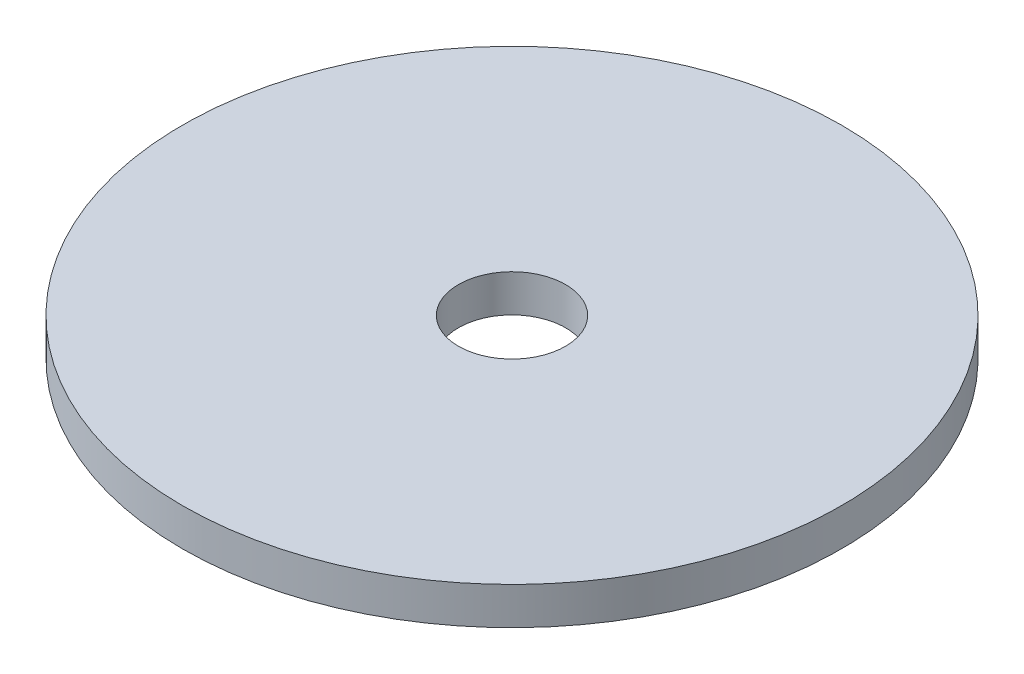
ISO-10303-21;
HEADER;
FILE_DESCRIPTION(('STEP AP214'),'2;1');
FILE_NAME('part.step','',(''),(''),'','','');
FILE_SCHEMA(('AUTOMOTIVE_DESIGN { 1 0 10303 214 1 1 1 1 }'));
ENDSEC;
DATA;
#1=APPLICATION_CONTEXT('core data for automotive mechanical design processes');
#2=APPLICATION_PROTOCOL_DEFINITION('international standard','automotive_design',2000,#1);
#3=PRODUCT_CONTEXT('',#1,'mechanical');
#4=PRODUCT('Part','Part','',(#3));
#5=PRODUCT_RELATED_PRODUCT_CATEGORY('part','',(#4));
#6=PRODUCT_DEFINITION_FORMATION('','',#4);
#7=PRODUCT_DEFINITION_CONTEXT('part definition',#1,'design');
#8=PRODUCT_DEFINITION('design','',#6,#7);
#9=PRODUCT_DEFINITION_SHAPE('','',#8);
#10=(LENGTH_UNIT() NAMED_UNIT(*) SI_UNIT(.MILLI.,.METRE.));
#11=(NAMED_UNIT(*) PLANE_ANGLE_UNIT() SI_UNIT($,.RADIAN.));
#12=(NAMED_UNIT(*) SI_UNIT($,.STERADIAN.) SOLID_ANGLE_UNIT());
#13=UNCERTAINTY_MEASURE_WITH_UNIT(LENGTH_MEASURE(1.E-05),#10,'distance_accuracy_value','');
#14=(GEOMETRIC_REPRESENTATION_CONTEXT(3) GLOBAL_UNCERTAINTY_ASSIGNED_CONTEXT((#13)) GLOBAL_UNIT_ASSIGNED_CONTEXT((#10,
#11,#12)) REPRESENTATION_CONTEXT('',''));
#15=CARTESIAN_POINT('',(0.,0.,0.));
#16=DIRECTION('',(0.,0.,1.));
#17=DIRECTION('',(1.,0.,0.));
#18=AXIS2_PLACEMENT_3D('',#15,#16,#17);
#19=CARTESIAN_POINT('',(0.,1.8034,0.));
#20=DIRECTION('',(0.,-1.,0.));
#21=DIRECTION('',(0.,0.,-1.));
#22=AXIS2_PLACEMENT_3D('',#19,#20,#21);
#23=CYLINDRICAL_SURFACE('',#22,15.875);
#24=CARTESIAN_POINT('',(0.,1.8034,0.));
#25=DIRECTION('',(0.,1.,0.));
#26=DIRECTION('',(0.,0.,1.));
#27=AXIS2_PLACEMENT_3D('',#24,#25,#26);
#28=CIRCLE('',#27,15.875);
#29=CARTESIAN_POINT('',(0.,1.8034,15.875));
#30=VERTEX_POINT('',#29);
#31=EDGE_CURVE('E10',#30,#30,#28,.T.);
#32=ORIENTED_EDGE('',*,*,#31,.F.);
#33=EDGE_LOOP('',(#32));
#34=FACE_BOUND('',#33,.T.);
#35=CARTESIAN_POINT('',(0.,0.,0.));
#36=DIRECTION('',(0.,1.,0.));
#37=DIRECTION('',(0.,0.,1.));
#38=AXIS2_PLACEMENT_3D('',#35,#36,#37);
#39=CIRCLE('',#38,15.875);
#40=CARTESIAN_POINT('',(0.,0.,15.875));
#41=VERTEX_POINT('',#40);
#42=EDGE_CURVE('E33',#41,#41,#39,.T.);
#43=ORIENTED_EDGE('',*,*,#42,.T.);
#44=EDGE_LOOP('',(#43));
#45=FACE_BOUND('',#44,.T.);
#46=ADVANCED_FACE('F30',(#34,#45),#23,.T.);
#47=CARTESIAN_POINT('',(0.,1.8034,0.));
#48=DIRECTION('',(0.,1.,0.));
#49=DIRECTION('',(0.,0.,1.));
#50=AXIS2_PLACEMENT_3D('',#47,#48,#49);
#51=PLANE('',#50);
#52=CARTESIAN_POINT('',(0.,1.8034,0.));
#53=DIRECTION('',(0.,1.,0.));
#54=DIRECTION('',(0.,0.,1.));
#55=AXIS2_PLACEMENT_3D('',#52,#53,#54);
#56=CIRCLE('',#55,2.5781);
#57=CARTESIAN_POINT('',(0.,1.8034,2.5781));
#58=VERTEX_POINT('',#57);
#59=EDGE_CURVE('E42',#58,#58,#56,.T.);
#60=ORIENTED_EDGE('',*,*,#59,.F.);
#61=EDGE_LOOP('',(#60));
#62=FACE_BOUND('',#61,.T.);
#63=ORIENTED_EDGE('',*,*,#31,.T.);
#64=EDGE_LOOP('',(#63));
#65=FACE_BOUND('',#64,.T.);
#66=ADVANCED_FACE('F57',(#62,#65),#51,.T.);
#67=CARTESIAN_POINT('',(0.,0.,0.));
#68=DIRECTION('',(0.,1.,0.));
#69=DIRECTION('',(0.,0.,1.));
#70=AXIS2_PLACEMENT_3D('',#67,#68,#69);
#71=PLANE('',#70);
#72=CARTESIAN_POINT('',(0.,0.,0.));
#73=DIRECTION('',(0.,1.,0.));
#74=DIRECTION('',(0.,0.,1.));
#75=AXIS2_PLACEMENT_3D('',#72,#73,#74);
#76=CIRCLE('',#75,2.5781);
#77=CARTESIAN_POINT('',(0.,0.,2.5781));
#78=VERTEX_POINT('',#77);
#79=EDGE_CURVE('E40',#78,#78,#76,.T.);
#80=ORIENTED_EDGE('',*,*,#79,.T.);
#81=EDGE_LOOP('',(#80));
#82=FACE_BOUND('',#81,.T.);
#83=ORIENTED_EDGE('',*,*,#42,.F.);
#84=EDGE_LOOP('',(#83));
#85=FACE_BOUND('',#84,.T.);
#86=ADVANCED_FACE('F48',(#82,#85),#71,.F.);
#87=CARTESIAN_POINT('',(0.,0.,0.));
#88=DIRECTION('',(0.,1.,0.));
#89=DIRECTION('',(0.,0.,1.));
#90=AXIS2_PLACEMENT_3D('',#87,#88,#89);
#91=CYLINDRICAL_SURFACE('',#90,2.5781);
#92=ORIENTED_EDGE('',*,*,#79,.F.);
#93=EDGE_LOOP('',(#92));
#94=FACE_BOUND('',#93,.T.);
#95=ORIENTED_EDGE('',*,*,#59,.T.);
#96=EDGE_LOOP('',(#95));
#97=FACE_BOUND('',#96,.T.);
#98=ADVANCED_FACE('F51',(#94,#97),#91,.F.);
#99=CLOSED_SHELL('',(#46,#66,#86,#98));
#100=MANIFOLD_SOLID_BREP('B2',#99);
#101=ADVANCED_BREP_SHAPE_REPRESENTATION('',(#18,#100),#14);
#102=SHAPE_DEFINITION_REPRESENTATION(#9,#101);
ENDSEC;
END-ISO-10303-21;
